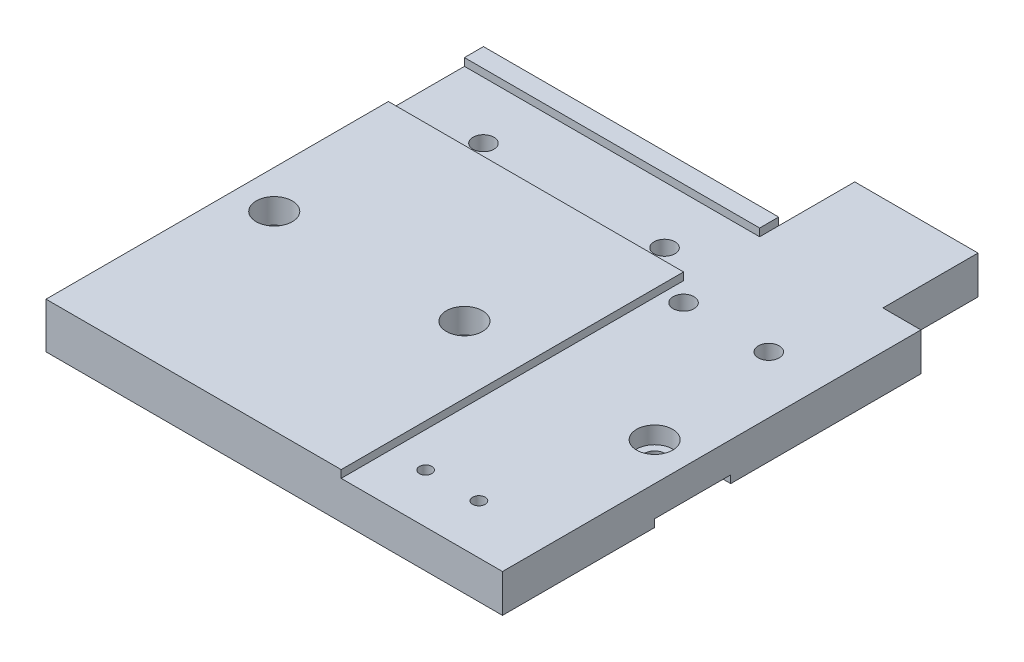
ISO-10303-21;
HEADER;
FILE_DESCRIPTION(('STEP AP214'),'2;1');
FILE_NAME('part.step','',(''),(''),'','','');
FILE_SCHEMA(('AUTOMOTIVE_DESIGN { 1 0 10303 214 1 1 1 1 }'));
ENDSEC;
DATA;
#1=APPLICATION_CONTEXT('core data for automotive mechanical design processes');
#2=APPLICATION_PROTOCOL_DEFINITION('international standard','automotive_design',2000,#1);
#3=PRODUCT_CONTEXT('',#1,'mechanical');
#4=PRODUCT('Part','Part','',(#3));
#5=PRODUCT_RELATED_PRODUCT_CATEGORY('part','',(#4));
#6=PRODUCT_DEFINITION_FORMATION('','',#4);
#7=PRODUCT_DEFINITION_CONTEXT('part definition',#1,'design');
#8=PRODUCT_DEFINITION('design','',#6,#7);
#9=PRODUCT_DEFINITION_SHAPE('','',#8);
#10=(LENGTH_UNIT() NAMED_UNIT(*) SI_UNIT(.MILLI.,.METRE.));
#11=(NAMED_UNIT(*) PLANE_ANGLE_UNIT() SI_UNIT($,.RADIAN.));
#12=(NAMED_UNIT(*) SI_UNIT($,.STERADIAN.) SOLID_ANGLE_UNIT());
#13=UNCERTAINTY_MEASURE_WITH_UNIT(LENGTH_MEASURE(1.E-05),#10,'distance_accuracy_value','');
#14=(GEOMETRIC_REPRESENTATION_CONTEXT(3) GLOBAL_UNCERTAINTY_ASSIGNED_CONTEXT((#13)) GLOBAL_UNIT_ASSIGNED_CONTEXT((#10,
#11,#12)) REPRESENTATION_CONTEXT('',''));
#15=CARTESIAN_POINT('',(0.,0.,0.));
#16=DIRECTION('',(0.,0.,1.));
#17=DIRECTION('',(1.,0.,0.));
#18=AXIS2_PLACEMENT_3D('',#15,#16,#17);
#19=CARTESIAN_POINT('',(77.5999999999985,10.0000000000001,135.));
#20=DIRECTION('',(-1.,0.,0.));
#21=DIRECTION('',(0.,0.,1.));
#22=AXIS2_PLACEMENT_3D('',#19,#20,#21);
#23=PLANE('',#22);
#24=DIRECTION('',(0.,0.,-1.));
#25=VECTOR('',#24,1.);
#26=CARTESIAN_POINT('',(77.5999999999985,10.0000000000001,135.));
#27=LINE('',#26,#25);
#28=CARTESIAN_POINT('',(77.5999999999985,10.0000000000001,135.));
#29=VERTEX_POINT('',#28);
#30=CARTESIAN_POINT('',(77.5999999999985,10.0000000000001,45.));
#31=VERTEX_POINT('',#30);
#32=EDGE_CURVE('E175',#29,#31,#27,.T.);
#33=ORIENTED_EDGE('',*,*,#32,.T.);
#34=DIRECTION('',(0.,1.,0.));
#35=VECTOR('',#34,1.);
#36=CARTESIAN_POINT('',(77.5999999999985,-70.1358845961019,45.));
#37=LINE('',#36,#35);
#38=CARTESIAN_POINT('',(77.5999999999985,12.0000000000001,45.));
#39=VERTEX_POINT('',#38);
#40=EDGE_CURVE('E157',#31,#39,#37,.T.);
#41=ORIENTED_EDGE('',*,*,#40,.T.);
#42=DIRECTION('',(0.,0.,-1.));
#43=VECTOR('',#42,1.);
#44=CARTESIAN_POINT('',(77.5999999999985,12.0000000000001,135.));
#45=LINE('',#44,#43);
#46=CARTESIAN_POINT('',(77.5999999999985,12.0000000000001,135.));
#47=VERTEX_POINT('',#46);
#48=EDGE_CURVE('E190',#47,#39,#45,.T.);
#49=ORIENTED_EDGE('',*,*,#48,.F.);
#50=DIRECTION('',(0.,1.,0.));
#51=VECTOR('',#50,1.);
#52=CARTESIAN_POINT('',(77.5999999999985,10.0000000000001,135.));
#53=LINE('',#52,#51);
#54=EDGE_CURVE('E183',#29,#47,#53,.T.);
#55=ORIENTED_EDGE('',*,*,#54,.F.);
#56=EDGE_LOOP('',(#33,#41,#49,#55));
#57=FACE_BOUND('',#56,.T.);
#58=ADVANCED_FACE('F34',(#57),#23,.F.);
#59=CARTESIAN_POINT('',(0.,12.0000000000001,135.));
#60=DIRECTION('',(0.,-1.,0.));
#61=DIRECTION('',(0.,0.,-1.));
#62=AXIS2_PLACEMENT_3D('',#59,#60,#61);
#63=PLANE('',#62);
#64=CARTESIAN_POINT('',(10.,12.0000000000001,85.));
#65=DIRECTION('',(0.,1.,0.));
#66=DIRECTION('',(0.,0.,1.));
#67=AXIS2_PLACEMENT_3D('',#64,#65,#66);
#68=CIRCLE('',#67,4.75);
#69=CARTESIAN_POINT('',(10.,12.0000000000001,89.75));
#70=VERTEX_POINT('',#69);
#71=EDGE_CURVE('E225',#70,#70,#68,.T.);
#72=ORIENTED_EDGE('',*,*,#71,.F.);
#73=EDGE_LOOP('',(#72));
#74=FACE_BOUND('',#73,.T.);
#75=CARTESIAN_POINT('',(60.,12.0000000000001,85.));
#76=DIRECTION('',(0.,1.,0.));
#77=DIRECTION('',(0.,0.,1.));
#78=AXIS2_PLACEMENT_3D('',#75,#76,#77);
#79=CIRCLE('',#78,4.75);
#80=CARTESIAN_POINT('',(60.,12.0000000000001,89.75));
#81=VERTEX_POINT('',#80);
#82=EDGE_CURVE('E232',#81,#81,#79,.T.);
#83=ORIENTED_EDGE('',*,*,#82,.F.);
#84=EDGE_LOOP('',(#83));
#85=FACE_BOUND('',#84,.T.);
#86=ORIENTED_EDGE('',*,*,#48,.T.);
#87=DIRECTION('',(1.,0.,0.));
#88=VECTOR('',#87,1.);
#89=CARTESIAN_POINT('',(0.,12.0000000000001,45.));
#90=LINE('',#89,#88);
#91=CARTESIAN_POINT('',(0.,12.0000000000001,45.));
#92=VERTEX_POINT('',#91);
#93=EDGE_CURVE('E163',#92,#39,#90,.T.);
#94=ORIENTED_EDGE('',*,*,#93,.F.);
#95=DIRECTION('',(0.,0.,-1.));
#96=VECTOR('',#95,1.);
#97=CARTESIAN_POINT('',(0.,12.0000000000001,135.));
#98=LINE('',#97,#96);
#99=CARTESIAN_POINT('',(0.,12.0000000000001,135.));
#100=VERTEX_POINT('',#99);
#101=EDGE_CURVE('E310',#100,#92,#98,.T.);
#102=ORIENTED_EDGE('',*,*,#101,.F.);
#103=DIRECTION('',(-1.,0.,0.));
#104=VECTOR('',#103,1.);
#105=CARTESIAN_POINT('',(0.,12.0000000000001,135.));
#106=LINE('',#105,#104);
#107=EDGE_CURVE('E298',#47,#100,#106,.T.);
#108=ORIENTED_EDGE('',*,*,#107,.F.);
#109=EDGE_LOOP('',(#86,#94,#102,#108));
#110=FACE_BOUND('',#109,.T.);
#111=ADVANCED_FACE('F408',(#74,#85,#110),#63,.F.);
#112=CARTESIAN_POINT('',(110.,-123.,85.));
#113=DIRECTION('',(0.,1.,0.));
#114=DIRECTION('',(0.,0.,1.));
#115=AXIS2_PLACEMENT_3D('',#112,#113,#114);
#116=CYLINDRICAL_SURFACE('',#115,2.75);
#117=CARTESIAN_POINT('',(110.,5.50000000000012,85.));
#118=DIRECTION('',(0.,1.,0.));
#119=DIRECTION('',(0.,0.,1.));
#120=AXIS2_PLACEMENT_3D('',#117,#118,#119);
#121=CIRCLE('',#120,2.75);
#122=CARTESIAN_POINT('',(110.,5.50000000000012,87.75));
#123=VERTEX_POINT('',#122);
#124=EDGE_CURVE('E227',#123,#123,#121,.F.);
#125=ORIENTED_EDGE('',*,*,#124,.F.);
#126=EDGE_LOOP('',(#125));
#127=FACE_BOUND('',#126,.T.);
#128=CARTESIAN_POINT('',(110.,2.00000000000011,85.));
#129=DIRECTION('',(0.,-1.,0.));
#130=DIRECTION('',(0.,0.,-1.));
#131=AXIS2_PLACEMENT_3D('',#128,#129,#130);
#132=CIRCLE('',#131,2.75);
#133=CARTESIAN_POINT('',(110.,2.00000000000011,82.25));
#134=VERTEX_POINT('',#133);
#135=EDGE_CURVE('E384',#134,#134,#132,.F.);
#136=ORIENTED_EDGE('',*,*,#135,.F.);
#137=EDGE_LOOP('',(#136));
#138=FACE_BOUND('',#137,.T.);
#139=ADVANCED_FACE('F413',(#127,#138),#116,.F.);
#140=CARTESIAN_POINT('',(60.,-123.,85.));
#141=DIRECTION('',(0.,1.,0.));
#142=DIRECTION('',(0.,0.,1.));
#143=AXIS2_PLACEMENT_3D('',#140,#141,#142);
#144=CYLINDRICAL_SURFACE('',#143,2.75);
#145=CARTESIAN_POINT('',(60.,5.50000000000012,85.));
#146=DIRECTION('',(0.,1.,0.));
#147=DIRECTION('',(0.,0.,1.));
#148=AXIS2_PLACEMENT_3D('',#145,#146,#147);
#149=CIRCLE('',#148,2.75);
#150=CARTESIAN_POINT('',(60.,5.50000000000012,87.75));
#151=VERTEX_POINT('',#150);
#152=EDGE_CURVE('E222',#151,#151,#149,.F.);
#153=ORIENTED_EDGE('',*,*,#152,.F.);
#154=EDGE_LOOP('',(#153));
#155=FACE_BOUND('',#154,.T.);
#156=CARTESIAN_POINT('',(60.,2.00000000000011,85.));
#157=DIRECTION('',(0.,-1.,0.));
#158=DIRECTION('',(0.,0.,-1.));
#159=AXIS2_PLACEMENT_3D('',#156,#157,#158);
#160=CIRCLE('',#159,2.75);
#161=CARTESIAN_POINT('',(60.,2.00000000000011,82.25));
#162=VERTEX_POINT('',#161);
#163=EDGE_CURVE('E381',#162,#162,#160,.F.);
#164=ORIENTED_EDGE('',*,*,#163,.F.);
#165=EDGE_LOOP('',(#164));
#166=FACE_BOUND('',#165,.T.);
#167=ADVANCED_FACE('F459',(#155,#166),#144,.F.);
#168=CARTESIAN_POINT('',(10.,-123.,85.));
#169=DIRECTION('',(0.,1.,0.));
#170=DIRECTION('',(0.,0.,1.));
#171=AXIS2_PLACEMENT_3D('',#168,#169,#170);
#172=CYLINDRICAL_SURFACE('',#171,2.75);
#173=CARTESIAN_POINT('',(10.,5.50000000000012,85.));
#174=DIRECTION('',(0.,1.,0.));
#175=DIRECTION('',(0.,0.,1.));
#176=AXIS2_PLACEMENT_3D('',#173,#174,#175);
#177=CIRCLE('',#176,2.75);
#178=CARTESIAN_POINT('',(10.,5.50000000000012,87.75));
#179=VERTEX_POINT('',#178);
#180=EDGE_CURVE('E217',#179,#179,#177,.F.);
#181=ORIENTED_EDGE('',*,*,#180,.F.);
#182=EDGE_LOOP('',(#181));
#183=FACE_BOUND('',#182,.T.);
#184=CARTESIAN_POINT('',(10.,2.00000000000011,85.));
#185=DIRECTION('',(0.,-1.,0.));
#186=DIRECTION('',(0.,0.,-1.));
#187=AXIS2_PLACEMENT_3D('',#184,#185,#186);
#188=CIRCLE('',#187,2.75);
#189=CARTESIAN_POINT('',(10.,2.00000000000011,82.25));
#190=VERTEX_POINT('',#189);
#191=EDGE_CURVE('E375',#190,#190,#188,.F.);
#192=ORIENTED_EDGE('',*,*,#191,.F.);
#193=EDGE_LOOP('',(#192));
#194=FACE_BOUND('',#193,.T.);
#195=ADVANCED_FACE('F463',(#183,#194),#172,.F.);
#196=CARTESIAN_POINT('',(0.,1.13686837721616E-13,135.));
#197=DIRECTION('',(0.,1.,0.));
#198=DIRECTION('',(0.,0.,1.));
#199=AXIS2_PLACEMENT_3D('',#196,#197,#198);
#200=PLANE('',#199);
#201=CARTESIAN_POINT('',(20.,1.11022302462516E-13,40.));
#202=DIRECTION('',(0.,1.,0.));
#203=DIRECTION('',(0.,0.,1.));
#204=AXIS2_PLACEMENT_3D('',#201,#202,#203);
#205=CIRCLE('',#204,2.75);
#206=CARTESIAN_POINT('',(20.,1.11022302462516E-13,42.75));
#207=VERTEX_POINT('',#206);
#208=EDGE_CURVE('E285',#207,#207,#205,.T.);
#209=ORIENTED_EDGE('',*,*,#208,.T.);
#210=EDGE_LOOP('',(#209));
#211=FACE_BOUND('',#210,.T.);
#212=CARTESIAN_POINT('',(67.5999999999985,1.11022302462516E-13,40.));
#213=DIRECTION('',(0.,1.,0.));
#214=DIRECTION('',(0.,0.,1.));
#215=AXIS2_PLACEMENT_3D('',#212,#213,#214);
#216=CIRCLE('',#215,2.75);
#217=CARTESIAN_POINT('',(67.5999999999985,1.11022302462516E-13,42.75));
#218=VERTEX_POINT('',#217);
#219=EDGE_CURVE('E282',#218,#218,#216,.T.);
#220=ORIENTED_EDGE('',*,*,#219,.T.);
#221=EDGE_LOOP('',(#220));
#222=FACE_BOUND('',#221,.T.);
#223=CARTESIAN_POINT('',(105.,1.11022302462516E-13,50.));
#224=DIRECTION('',(0.,1.,0.));
#225=DIRECTION('',(0.,0.,1.));
#226=AXIS2_PLACEMENT_3D('',#223,#224,#225);
#227=CIRCLE('',#226,2.75);
#228=CARTESIAN_POINT('',(105.,1.11022302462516E-13,52.75));
#229=VERTEX_POINT('',#228);
#230=EDGE_CURVE('E201',#229,#229,#227,.T.);
#231=ORIENTED_EDGE('',*,*,#230,.T.);
#232=EDGE_LOOP('',(#231));
#233=FACE_BOUND('',#232,.T.);
#234=CARTESIAN_POINT('',(82.5999999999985,1.11022302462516E-13,50.));
#235=DIRECTION('',(0.,1.,0.));
#236=DIRECTION('',(0.,0.,1.));
#237=AXIS2_PLACEMENT_3D('',#234,#235,#236);
#238=CIRCLE('',#237,2.75);
#239=CARTESIAN_POINT('',(82.5999999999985,1.11022302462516E-13,52.75));
#240=VERTEX_POINT('',#239);
#241=EDGE_CURVE('E202',#240,#240,#238,.T.);
#242=ORIENTED_EDGE('',*,*,#241,.T.);
#243=EDGE_LOOP('',(#242));
#244=FACE_BOUND('',#243,.T.);
#245=DIRECTION('',(1.,0.,0.));
#246=VECTOR('',#245,1.);
#247=CARTESIAN_POINT('',(0.,1.13686837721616E-13,74.9999999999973));
#248=LINE('',#247,#246);
#249=CARTESIAN_POINT('',(0.,1.13686837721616E-13,74.9999999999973));
#250=VERTEX_POINT('',#249);
#251=CARTESIAN_POINT('',(120.,1.13686837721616E-13,74.9999999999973));
#252=VERTEX_POINT('',#251);
#253=EDGE_CURVE('E350',#250,#252,#248,.T.);
#254=ORIENTED_EDGE('',*,*,#253,.F.);
#255=DIRECTION('',(0.,0.,-1.));
#256=VECTOR('',#255,1.);
#257=CARTESIAN_POINT('',(0.,1.13686837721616E-13,135.));
#258=LINE('',#257,#256);
#259=CARTESIAN_POINT('',(0.,1.11022302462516E-13,20.));
#260=VERTEX_POINT('',#259);
#261=EDGE_CURVE('E302',#250,#260,#258,.T.);
#262=ORIENTED_EDGE('',*,*,#261,.T.);
#263=DIRECTION('',(-1.,0.,0.));
#264=VECTOR('',#263,1.);
#265=CARTESIAN_POINT('',(0.,1.13686837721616E-13,20.));
#266=LINE('',#265,#264);
#267=CARTESIAN_POINT('',(77.5999999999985,1.11022302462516E-13,20.));
#268=VERTEX_POINT('',#267);
#269=EDGE_CURVE('E270',#268,#260,#266,.T.);
#270=ORIENTED_EDGE('',*,*,#269,.F.);
#271=DIRECTION('',(0.,0.,1.));
#272=VECTOR('',#271,1.);
#273=CARTESIAN_POINT('',(77.5999999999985,1.13686837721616E-13,135.));
#274=LINE('',#273,#272);
#275=CARTESIAN_POINT('',(77.5999999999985,1.11022302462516E-13,0.));
#276=VERTEX_POINT('',#275);
#277=EDGE_CURVE('E268',#276,#268,#274,.T.);
#278=ORIENTED_EDGE('',*,*,#277,.F.);
#279=DIRECTION('',(1.,0.,0.));
#280=VECTOR('',#279,1.);
#281=CARTESIAN_POINT('',(0.,1.13686837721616E-13,0.));
#282=LINE('',#281,#280);
#283=CARTESIAN_POINT('',(110.,1.13686837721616E-13,0.));
#284=VERTEX_POINT('',#283);
#285=EDGE_CURVE('E288',#276,#284,#282,.T.);
#286=ORIENTED_EDGE('',*,*,#285,.T.);
#287=DIRECTION('',(0.,0.,-1.));
#288=VECTOR('',#287,1.);
#289=CARTESIAN_POINT('',(110.,1.13686837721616E-13,135.));
#290=LINE('',#289,#288);
#291=CARTESIAN_POINT('',(110.,1.11022302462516E-13,25.));
#292=VERTEX_POINT('',#291);
#293=EDGE_CURVE('E264',#292,#284,#290,.T.);
#294=ORIENTED_EDGE('',*,*,#293,.F.);
#295=DIRECTION('',(-1.,0.,0.));
#296=VECTOR('',#295,1.);
#297=CARTESIAN_POINT('',(0.,1.13686837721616E-13,25.));
#298=LINE('',#297,#296);
#299=CARTESIAN_POINT('',(120.,1.11022302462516E-13,25.));
#300=VERTEX_POINT('',#299);
#301=EDGE_CURVE('E214',#300,#292,#298,.T.);
#302=ORIENTED_EDGE('',*,*,#301,.F.);
#303=DIRECTION('',(0.,0.,-1.));
#304=VECTOR('',#303,1.);
#305=CARTESIAN_POINT('',(120.,1.13686837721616E-13,135.));
#306=LINE('',#305,#304);
#307=EDGE_CURVE('E188',#252,#300,#306,.T.);
#308=ORIENTED_EDGE('',*,*,#307,.F.);
#309=EDGE_LOOP('',(#254,#262,#270,#278,#286,#294,#302,#308));
#310=FACE_BOUND('',#309,.T.);
#311=ADVANCED_FACE('F36',(#211,#222,#233,#244,#310),#200,.F.);
#312=CARTESIAN_POINT('',(86.7999999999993,1.11022302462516E-13,122.));
#313=DIRECTION('',(0.,1.,0.));
#314=DIRECTION('',(0.,0.,1.));
#315=AXIS2_PLACEMENT_3D('',#312,#313,#314);
#316=CIRCLE('',#315,1.65);
#317=CARTESIAN_POINT('',(86.7999999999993,1.11022302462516E-13,123.65));
#318=VERTEX_POINT('',#317);
#319=EDGE_CURVE('E206',#318,#318,#316,.T.);
#320=ORIENTED_EDGE('',*,*,#319,.T.);
#321=EDGE_LOOP('',(#320));
#322=FACE_BOUND('',#321,.T.);
#323=CARTESIAN_POINT('',(100.799999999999,1.11022302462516E-13,122.));
#324=DIRECTION('',(0.,1.,0.));
#325=DIRECTION('',(0.,0.,1.));
#326=AXIS2_PLACEMENT_3D('',#323,#324,#325);
#327=CIRCLE('',#326,1.65);
#328=CARTESIAN_POINT('',(100.799999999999,1.11022302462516E-13,123.65));
#329=VERTEX_POINT('',#328);
#330=EDGE_CURVE('E210',#329,#329,#327,.T.);
#331=ORIENTED_EDGE('',*,*,#330,.T.);
#332=EDGE_LOOP('',(#331));
#333=FACE_BOUND('',#332,.T.);
#334=DIRECTION('',(1.,0.,0.));
#335=VECTOR('',#334,1.);
#336=CARTESIAN_POINT('',(0.,0.,94.9999999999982));
#337=LINE('',#336,#335);
#338=CARTESIAN_POINT('',(0.,1.13686837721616E-13,94.9999999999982));
#339=VERTEX_POINT('',#338);
#340=CARTESIAN_POINT('',(120.,0.,94.9999999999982));
#341=VERTEX_POINT('',#340);
#342=EDGE_CURVE('E59',#339,#341,#337,.T.);
#343=ORIENTED_EDGE('',*,*,#342,.T.);
#344=CARTESIAN_POINT('',(120.,1.13686837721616E-13,135.));
#345=VERTEX_POINT('',#344);
#346=EDGE_CURVE('E194',#345,#341,#306,.T.);
#347=ORIENTED_EDGE('',*,*,#346,.F.);
#348=DIRECTION('',(1.,0.,0.));
#349=VECTOR('',#348,1.);
#350=CARTESIAN_POINT('',(0.,1.13686837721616E-13,135.));
#351=LINE('',#350,#349);
#352=CARTESIAN_POINT('',(0.,1.13686837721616E-13,135.));
#353=VERTEX_POINT('',#352);
#354=EDGE_CURVE('E289',#353,#345,#351,.T.);
#355=ORIENTED_EDGE('',*,*,#354,.F.);
#356=EDGE_CURVE('E307',#353,#339,#258,.T.);
#357=ORIENTED_EDGE('',*,*,#356,.T.);
#358=EDGE_LOOP('',(#343,#347,#355,#357));
#359=FACE_BOUND('',#358,.T.);
#360=ADVANCED_FACE('F428',(#322,#333,#359),#200,.F.);
#361=CARTESIAN_POINT('',(120.,1.13686837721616E-13,135.));
#362=DIRECTION('',(-1.,0.,0.));
#363=DIRECTION('',(0.,0.,1.));
#364=AXIS2_PLACEMENT_3D('',#361,#362,#363);
#365=PLANE('',#364);
#366=DIRECTION('',(0.,-1.,0.));
#367=VECTOR('',#366,1.);
#368=CARTESIAN_POINT('',(120.,1.13686837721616E-13,74.9999999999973));
#369=LINE('',#368,#367);
#370=CARTESIAN_POINT('',(120.,2.00000000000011,74.9999999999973));
#371=VERTEX_POINT('',#370);
#372=EDGE_CURVE('E371',#371,#252,#369,.T.);
#373=ORIENTED_EDGE('',*,*,#372,.T.);
#374=ORIENTED_EDGE('',*,*,#307,.T.);
#375=DIRECTION('',(0.,1.,0.));
#376=VECTOR('',#375,1.);
#377=CARTESIAN_POINT('',(120.,-123.,25.));
#378=LINE('',#377,#376);
#379=CARTESIAN_POINT('',(120.,10.0000000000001,25.));
#380=VERTEX_POINT('',#379);
#381=EDGE_CURVE('E249',#300,#380,#378,.T.);
#382=ORIENTED_EDGE('',*,*,#381,.T.);
#383=DIRECTION('',(0.,0.,-1.));
#384=VECTOR('',#383,1.);
#385=CARTESIAN_POINT('',(120.,10.0000000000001,135.));
#386=LINE('',#385,#384);
#387=CARTESIAN_POINT('',(120.,10.0000000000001,135.));
#388=VERTEX_POINT('',#387);
#389=EDGE_CURVE('E184',#388,#380,#386,.T.);
#390=ORIENTED_EDGE('',*,*,#389,.F.);
#391=DIRECTION('',(0.,1.,0.));
#392=VECTOR('',#391,1.);
#393=CARTESIAN_POINT('',(120.,1.13686837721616E-13,135.));
#394=LINE('',#393,#392);
#395=EDGE_CURVE('E292',#345,#388,#394,.T.);
#396=ORIENTED_EDGE('',*,*,#395,.F.);
#397=ORIENTED_EDGE('',*,*,#346,.T.);
#398=DIRECTION('',(0.,1.,4.57966997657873E-13));
#399=VECTOR('',#398,1.);
#400=CARTESIAN_POINT('',(120.,0.,94.9999999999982));
#401=LINE('',#400,#399);
#402=CARTESIAN_POINT('',(120.,2.00000000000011,94.9999999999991));
#403=VERTEX_POINT('',#402);
#404=EDGE_CURVE('E364',#341,#403,#401,.T.);
#405=ORIENTED_EDGE('',*,*,#404,.T.);
#406=DIRECTION('',(0.,0.,-1.));
#407=VECTOR('',#406,1.);
#408=CARTESIAN_POINT('',(120.,2.00000000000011,94.9999999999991));
#409=LINE('',#408,#407);
#410=EDGE_CURVE('E367',#403,#371,#409,.T.);
#411=ORIENTED_EDGE('',*,*,#410,.T.);
#412=EDGE_LOOP('',(#373,#374,#382,#390,#396,#397,#405,#411));
#413=FACE_BOUND('',#412,.T.);
#414=ADVANCED_FACE('F425',(#413),#365,.F.);
#415=CARTESIAN_POINT('',(0.,1.13686837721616E-13,135.));
#416=DIRECTION('',(1.,0.,0.));
#417=DIRECTION('',(0.,0.,-1.));
#418=AXIS2_PLACEMENT_3D('',#415,#416,#417);
#419=PLANE('',#418);
#420=ORIENTED_EDGE('',*,*,#101,.T.);
#421=DIRECTION('',(0.,1.,0.));
#422=VECTOR('',#421,1.);
#423=CARTESIAN_POINT('',(0.,-70.1358845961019,45.));
#424=LINE('',#423,#422);
#425=CARTESIAN_POINT('',(0.,10.0000000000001,45.));
#426=VERTEX_POINT('',#425);
#427=EDGE_CURVE('E730',#426,#92,#424,.T.);
#428=ORIENTED_EDGE('',*,*,#427,.F.);
#429=DIRECTION('',(0.,0.,1.));
#430=VECTOR('',#429,1.);
#431=CARTESIAN_POINT('',(0.,10.0000000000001,25.));
#432=LINE('',#431,#430);
#433=CARTESIAN_POINT('',(0.,10.0000000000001,25.));
#434=VERTEX_POINT('',#433);
#435=EDGE_CURVE('E179',#434,#426,#432,.T.);
#436=ORIENTED_EDGE('',*,*,#435,.F.);
#437=DIRECTION('',(0.,1.,0.));
#438=VECTOR('',#437,1.);
#439=CARTESIAN_POINT('',(0.,-70.1358845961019,25.));
#440=LINE('',#439,#438);
#441=CARTESIAN_POINT('',(0.,12.0000000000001,25.));
#442=VERTEX_POINT('',#441);
#443=EDGE_CURVE('E321',#434,#442,#440,.T.);
#444=ORIENTED_EDGE('',*,*,#443,.T.);
#445=CARTESIAN_POINT('',(0.,12.0000000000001,20.));
#446=VERTEX_POINT('',#445);
#447=EDGE_CURVE('E309',#442,#446,#98,.T.);
#448=ORIENTED_EDGE('',*,*,#447,.T.);
#449=DIRECTION('',(0.,1.,0.));
#450=VECTOR('',#449,1.);
#451=CARTESIAN_POINT('',(0.,-123.,20.));
#452=LINE('',#451,#450);
#453=EDGE_CURVE('E250',#260,#446,#452,.T.);
#454=ORIENTED_EDGE('',*,*,#453,.F.);
#455=ORIENTED_EDGE('',*,*,#261,.F.);
#456=DIRECTION('',(0.,-1.,0.));
#457=VECTOR('',#456,1.);
#458=CARTESIAN_POINT('',(0.,1.13686837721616E-13,74.9999999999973));
#459=LINE('',#458,#457);
#460=CARTESIAN_POINT('',(0.,2.00000000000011,74.9999999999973));
#461=VERTEX_POINT('',#460);
#462=EDGE_CURVE('E353',#461,#250,#459,.T.);
#463=ORIENTED_EDGE('',*,*,#462,.F.);
#464=DIRECTION('',(0.,0.,-1.));
#465=VECTOR('',#464,1.);
#466=CARTESIAN_POINT('',(0.,2.00000000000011,94.9999999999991));
#467=LINE('',#466,#465);
#468=CARTESIAN_POINT('',(0.,2.00000000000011,94.9999999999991));
#469=VERTEX_POINT('',#468);
#470=EDGE_CURVE('E355',#469,#461,#467,.T.);
#471=ORIENTED_EDGE('',*,*,#470,.F.);
#472=DIRECTION('',(0.,1.,4.57966997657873E-13));
#473=VECTOR('',#472,1.);
#474=CARTESIAN_POINT('',(0.,0.,94.9999999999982));
#475=LINE('',#474,#473);
#476=EDGE_CURVE('E360',#339,#469,#475,.T.);
#477=ORIENTED_EDGE('',*,*,#476,.F.);
#478=ORIENTED_EDGE('',*,*,#356,.F.);
#479=DIRECTION('',(0.,-1.,0.));
#480=VECTOR('',#479,1.);
#481=CARTESIAN_POINT('',(0.,1.13686837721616E-13,135.));
#482=LINE('',#481,#480);
#483=EDGE_CURVE('E300',#100,#353,#482,.T.);
#484=ORIENTED_EDGE('',*,*,#483,.F.);
#485=EDGE_LOOP('',(#420,#428,#436,#444,#448,#454,#455,#463,#471,#477,#478,#484));
#486=FACE_BOUND('',#485,.T.);
#487=ADVANCED_FACE('F319',(#486),#419,.F.);
#488=CARTESIAN_POINT('',(77.5999999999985,10.0000000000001,135.));
#489=DIRECTION('',(0.,-1.,0.));
#490=DIRECTION('',(0.,0.,-1.));
#491=AXIS2_PLACEMENT_3D('',#488,#489,#490);
#492=PLANE('',#491);
#493=DIRECTION('',(0.,0.,-1.));
#494=VECTOR('',#493,1.);
#495=CARTESIAN_POINT('',(77.5999999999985,10.0000000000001,135.));
#496=LINE('',#495,#494);
#497=CARTESIAN_POINT('',(77.5999999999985,10.0000000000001,20.));
#498=VERTEX_POINT('',#497);
#499=CARTESIAN_POINT('',(77.5999999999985,10.0000000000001,0.));
#500=VERTEX_POINT('',#499);
#501=EDGE_CURVE('E266',#498,#500,#496,.T.);
#502=ORIENTED_EDGE('',*,*,#501,.F.);
#503=CARTESIAN_POINT('',(77.5999999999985,10.0000000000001,25.));
#504=VERTEX_POINT('',#503);
#505=EDGE_CURVE('E185',#504,#498,#27,.T.);
#506=ORIENTED_EDGE('',*,*,#505,.F.);
#507=DIRECTION('',(-1.,0.,0.));
#508=VECTOR('',#507,1.);
#509=CARTESIAN_POINT('',(0.,10.0000000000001,25.));
#510=LINE('',#509,#508);
#511=EDGE_CURVE('E733',#504,#434,#510,.T.);
#512=ORIENTED_EDGE('',*,*,#511,.T.);
#513=ORIENTED_EDGE('',*,*,#435,.T.);
#514=DIRECTION('',(1.,0.,0.));
#515=VECTOR('',#514,1.);
#516=CARTESIAN_POINT('',(0.,10.0000000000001,45.));
#517=LINE('',#516,#515);
#518=EDGE_CURVE('E160',#426,#31,#517,.T.);
#519=ORIENTED_EDGE('',*,*,#518,.T.);
#520=ORIENTED_EDGE('',*,*,#32,.F.);
#521=DIRECTION('',(-1.,0.,0.));
#522=VECTOR('',#521,1.);
#523=CARTESIAN_POINT('',(77.5999999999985,10.0000000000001,135.));
#524=LINE('',#523,#522);
#525=EDGE_CURVE('E295',#388,#29,#524,.T.);
#526=ORIENTED_EDGE('',*,*,#525,.F.);
#527=ORIENTED_EDGE('',*,*,#389,.T.);
#528=DIRECTION('',(1.,0.,0.));
#529=VECTOR('',#528,1.);
#530=CARTESIAN_POINT('',(77.5999999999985,10.0000000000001,25.));
#531=LINE('',#530,#529);
#532=CARTESIAN_POINT('',(110.,10.0000000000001,25.));
#533=VERTEX_POINT('',#532);
#534=EDGE_CURVE('E12',#533,#380,#531,.T.);
#535=ORIENTED_EDGE('',*,*,#534,.F.);
#536=DIRECTION('',(0.,0.,1.));
#537=VECTOR('',#536,1.);
#538=CARTESIAN_POINT('',(110.,10.0000000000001,135.));
#539=LINE('',#538,#537);
#540=CARTESIAN_POINT('',(110.,10.0000000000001,0.));
#541=VERTEX_POINT('',#540);
#542=EDGE_CURVE('E253',#541,#533,#539,.T.);
#543=ORIENTED_EDGE('',*,*,#542,.F.);
#544=DIRECTION('',(-1.,0.,0.));
#545=VECTOR('',#544,1.);
#546=CARTESIAN_POINT('',(77.5999999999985,10.0000000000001,0.));
#547=LINE('',#546,#545);
#548=EDGE_CURVE('E293',#541,#500,#547,.T.);
#549=ORIENTED_EDGE('',*,*,#548,.T.);
#550=EDGE_LOOP('',(#502,#506,#512,#513,#519,#520,#526,#527,#535,#543,#549));
#551=FACE_BOUND('',#550,.T.);
#552=CARTESIAN_POINT('',(100.799999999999,10.0000000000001,122.));
#553=DIRECTION('',(0.,-1.,0.));
#554=DIRECTION('',(0.,0.,-1.));
#555=AXIS2_PLACEMENT_3D('',#552,#553,#554);
#556=CIRCLE('',#555,1.65);
#557=CARTESIAN_POINT('',(100.799999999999,10.0000000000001,120.35));
#558=VERTEX_POINT('',#557);
#559=EDGE_CURVE('E211',#558,#558,#556,.T.);
#560=ORIENTED_EDGE('',*,*,#559,.T.);
#561=EDGE_LOOP('',(#560));
#562=FACE_BOUND('',#561,.T.);
#563=CARTESIAN_POINT('',(86.7999999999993,10.0000000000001,122.));
#564=DIRECTION('',(0.,-1.,0.));
#565=DIRECTION('',(0.,0.,-1.));
#566=AXIS2_PLACEMENT_3D('',#563,#564,#565);
#567=CIRCLE('',#566,1.65);
#568=CARTESIAN_POINT('',(86.7999999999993,10.0000000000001,120.35));
#569=VERTEX_POINT('',#568);
#570=EDGE_CURVE('E207',#569,#569,#567,.T.);
#571=ORIENTED_EDGE('',*,*,#570,.T.);
#572=EDGE_LOOP('',(#571));
#573=FACE_BOUND('',#572,.T.);
#574=CARTESIAN_POINT('',(82.5999999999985,10.0000000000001,50.));
#575=DIRECTION('',(0.,-1.,0.));
#576=DIRECTION('',(0.,0.,-1.));
#577=AXIS2_PLACEMENT_3D('',#574,#575,#576);
#578=CIRCLE('',#577,2.75);
#579=CARTESIAN_POINT('',(82.5999999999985,10.0000000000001,47.25));
#580=VERTEX_POINT('',#579);
#581=EDGE_CURVE('E203',#580,#580,#578,.T.);
#582=ORIENTED_EDGE('',*,*,#581,.T.);
#583=EDGE_LOOP('',(#582));
#584=FACE_BOUND('',#583,.T.);
#585=CARTESIAN_POINT('',(105.,10.0000000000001,50.));
#586=DIRECTION('',(0.,-1.,0.));
#587=DIRECTION('',(0.,0.,-1.));
#588=AXIS2_PLACEMENT_3D('',#585,#586,#587);
#589=CIRCLE('',#588,2.75);
#590=CARTESIAN_POINT('',(105.,10.0000000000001,47.25));
#591=VERTEX_POINT('',#590);
#592=EDGE_CURVE('E198',#591,#591,#589,.T.);
#593=ORIENTED_EDGE('',*,*,#592,.T.);
#594=EDGE_LOOP('',(#593));
#595=FACE_BOUND('',#594,.T.);
#596=CARTESIAN_POINT('',(110.,10.0000000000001,85.));
#597=DIRECTION('',(0.,-1.,0.));
#598=DIRECTION('',(0.,0.,-1.));
#599=AXIS2_PLACEMENT_3D('',#596,#597,#598);
#600=CIRCLE('',#599,4.75);
#601=CARTESIAN_POINT('',(110.,10.0000000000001,89.75));
#602=VERTEX_POINT('',#601);
#603=EDGE_CURVE('E229',#602,#602,#600,.T.);
#604=ORIENTED_EDGE('',*,*,#603,.T.);
#605=EDGE_LOOP('',(#604));
#606=FACE_BOUND('',#605,.T.);
#607=CARTESIAN_POINT('',(67.5999999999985,10.0000000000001,40.));
#608=DIRECTION('',(0.,-1.,0.));
#609=DIRECTION('',(0.,0.,-1.));
#610=AXIS2_PLACEMENT_3D('',#607,#608,#609);
#611=CIRCLE('',#610,2.75);
#612=CARTESIAN_POINT('',(67.5999999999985,10.0000000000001,37.25));
#613=VERTEX_POINT('',#612);
#614=EDGE_CURVE('E38',#613,#613,#611,.F.);
#615=ORIENTED_EDGE('',*,*,#614,.F.);
#616=EDGE_LOOP('',(#615));
#617=FACE_BOUND('',#616,.T.);
#618=CARTESIAN_POINT('',(20.,10.0000000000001,40.));
#619=DIRECTION('',(0.,-1.,0.));
#620=DIRECTION('',(0.,0.,-1.));
#621=AXIS2_PLACEMENT_3D('',#618,#619,#620);
#622=CIRCLE('',#621,2.75);
#623=CARTESIAN_POINT('',(20.,10.0000000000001,37.25));
#624=VERTEX_POINT('',#623);
#625=EDGE_CURVE('E368',#624,#624,#622,.F.);
#626=ORIENTED_EDGE('',*,*,#625,.F.);
#627=EDGE_LOOP('',(#626));
#628=FACE_BOUND('',#627,.T.);
#629=ADVANCED_FACE('F172',(#551,#562,#573,#584,#595,#606,#617,#628),#492,.F.);
#630=CARTESIAN_POINT('',(77.5999999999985,12.0000000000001,25.));
#631=VERTEX_POINT('',#630);
#632=CARTESIAN_POINT('',(77.5999999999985,12.0000000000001,20.));
#633=VERTEX_POINT('',#632);
#634=EDGE_CURVE('E312',#631,#633,#45,.T.);
#635=ORIENTED_EDGE('',*,*,#634,.F.);
#636=DIRECTION('',(0.,1.,0.));
#637=VECTOR('',#636,1.);
#638=CARTESIAN_POINT('',(77.5999999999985,-70.1358845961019,25.));
#639=LINE('',#638,#637);
#640=EDGE_CURVE('E51',#504,#631,#639,.T.);
#641=ORIENTED_EDGE('',*,*,#640,.F.);
#642=ORIENTED_EDGE('',*,*,#505,.T.);
#643=DIRECTION('',(0.,1.,0.));
#644=VECTOR('',#643,1.);
#645=CARTESIAN_POINT('',(77.5999999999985,-123.,20.));
#646=LINE('',#645,#644);
#647=EDGE_CURVE('E255',#498,#633,#646,.T.);
#648=ORIENTED_EDGE('',*,*,#647,.T.);
#649=EDGE_LOOP('',(#635,#641,#642,#648));
#650=FACE_BOUND('',#649,.T.);
#651=ADVANCED_FACE('F332',(#650),#23,.F.);
#652=ORIENTED_EDGE('',*,*,#447,.F.);
#653=DIRECTION('',(-1.,0.,0.));
#654=VECTOR('',#653,1.);
#655=CARTESIAN_POINT('',(0.,12.0000000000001,25.));
#656=LINE('',#655,#654);
#657=EDGE_CURVE('E181',#631,#442,#656,.T.);
#658=ORIENTED_EDGE('',*,*,#657,.F.);
#659=ORIENTED_EDGE('',*,*,#634,.T.);
#660=DIRECTION('',(-1.,0.,0.));
#661=VECTOR('',#660,1.);
#662=CARTESIAN_POINT('',(0.,12.0000000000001,20.));
#663=LINE('',#662,#661);
#664=EDGE_CURVE('E220',#633,#446,#663,.T.);
#665=ORIENTED_EDGE('',*,*,#664,.T.);
#666=EDGE_LOOP('',(#652,#658,#659,#665));
#667=FACE_BOUND('',#666,.T.);
#668=ADVANCED_FACE('F329',(#667),#63,.F.);
#669=CARTESIAN_POINT('',(120.,1.13686837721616E-13,0.));
#670=DIRECTION('',(0.,0.,1.));
#671=DIRECTION('',(1.,0.,0.));
#672=AXIS2_PLACEMENT_3D('',#669,#670,#671);
#673=PLANE('',#672);
#674=DIRECTION('',(0.,-1.,0.));
#675=VECTOR('',#674,1.);
#676=CARTESIAN_POINT('',(77.5999999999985,1.13686837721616E-13,0.));
#677=LINE('',#676,#675);
#678=EDGE_CURVE('E43',#500,#276,#677,.T.);
#679=ORIENTED_EDGE('',*,*,#678,.F.);
#680=ORIENTED_EDGE('',*,*,#548,.F.);
#681=DIRECTION('',(0.,1.,0.));
#682=VECTOR('',#681,1.);
#683=CARTESIAN_POINT('',(110.,1.13686837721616E-13,0.));
#684=LINE('',#683,#682);
#685=EDGE_CURVE('E197',#284,#541,#684,.T.);
#686=ORIENTED_EDGE('',*,*,#685,.F.);
#687=ORIENTED_EDGE('',*,*,#285,.F.);
#688=EDGE_LOOP('',(#679,#680,#686,#687));
#689=FACE_BOUND('',#688,.T.);
#690=ADVANCED_FACE('F344',(#689),#673,.F.);
#691=CARTESIAN_POINT('',(120.,1.13686837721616E-13,135.));
#692=DIRECTION('',(0.,0.,1.));
#693=DIRECTION('',(1.,0.,0.));
#694=AXIS2_PLACEMENT_3D('',#691,#692,#693);
#695=PLANE('',#694);
#696=ORIENTED_EDGE('',*,*,#354,.T.);
#697=ORIENTED_EDGE('',*,*,#395,.T.);
#698=ORIENTED_EDGE('',*,*,#525,.T.);
#699=ORIENTED_EDGE('',*,*,#54,.T.);
#700=ORIENTED_EDGE('',*,*,#107,.T.);
#701=ORIENTED_EDGE('',*,*,#483,.T.);
#702=EDGE_LOOP('',(#696,#697,#698,#699,#700,#701));
#703=FACE_BOUND('',#702,.T.);
#704=ADVANCED_FACE('F486',(#703),#695,.T.);
#705=CARTESIAN_POINT('',(20.,-123.,40.));
#706=DIRECTION('',(0.,1.,0.));
#707=DIRECTION('',(0.,0.,1.));
#708=AXIS2_PLACEMENT_3D('',#705,#706,#707);
#709=CYLINDRICAL_SURFACE('',#708,2.75);
#710=ORIENTED_EDGE('',*,*,#625,.T.);
#711=EDGE_LOOP('',(#710));
#712=FACE_BOUND('',#711,.T.);
#713=ORIENTED_EDGE('',*,*,#208,.F.);
#714=EDGE_LOOP('',(#713));
#715=FACE_BOUND('',#714,.T.);
#716=ADVANCED_FACE('F482',(#712,#715),#709,.F.);
#717=CARTESIAN_POINT('',(67.5999999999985,-123.,40.));
#718=DIRECTION('',(0.,1.,0.));
#719=DIRECTION('',(0.,0.,1.));
#720=AXIS2_PLACEMENT_3D('',#717,#718,#719);
#721=CYLINDRICAL_SURFACE('',#720,2.75);
#722=ORIENTED_EDGE('',*,*,#614,.T.);
#723=EDGE_LOOP('',(#722));
#724=FACE_BOUND('',#723,.T.);
#725=ORIENTED_EDGE('',*,*,#219,.F.);
#726=EDGE_LOOP('',(#725));
#727=FACE_BOUND('',#726,.T.);
#728=ADVANCED_FACE('F478',(#724,#727),#721,.F.);
#729=CARTESIAN_POINT('',(105.,-123.,50.));
#730=DIRECTION('',(0.,1.,0.));
#731=DIRECTION('',(0.,0.,1.));
#732=AXIS2_PLACEMENT_3D('',#729,#730,#731);
#733=CYLINDRICAL_SURFACE('',#732,2.75);
#734=ORIENTED_EDGE('',*,*,#592,.F.);
#735=EDGE_LOOP('',(#734));
#736=FACE_BOUND('',#735,.T.);
#737=ORIENTED_EDGE('',*,*,#230,.F.);
#738=EDGE_LOOP('',(#737));
#739=FACE_BOUND('',#738,.T.);
#740=ADVANCED_FACE('F474',(#736,#739),#733,.F.);
#741=CARTESIAN_POINT('',(82.5999999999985,-123.,50.));
#742=DIRECTION('',(0.,1.,0.));
#743=DIRECTION('',(0.,0.,1.));
#744=AXIS2_PLACEMENT_3D('',#741,#742,#743);
#745=CYLINDRICAL_SURFACE('',#744,2.75);
#746=ORIENTED_EDGE('',*,*,#581,.F.);
#747=EDGE_LOOP('',(#746));
#748=FACE_BOUND('',#747,.T.);
#749=ORIENTED_EDGE('',*,*,#241,.F.);
#750=EDGE_LOOP('',(#749));
#751=FACE_BOUND('',#750,.T.);
#752=ADVANCED_FACE('F470',(#748,#751),#745,.F.);
#753=CARTESIAN_POINT('',(86.7999999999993,-123.,122.));
#754=DIRECTION('',(0.,1.,0.));
#755=DIRECTION('',(0.,0.,1.));
#756=AXIS2_PLACEMENT_3D('',#753,#754,#755);
#757=CYLINDRICAL_SURFACE('',#756,1.65);
#758=ORIENTED_EDGE('',*,*,#570,.F.);
#759=EDGE_LOOP('',(#758));
#760=FACE_BOUND('',#759,.T.);
#761=ORIENTED_EDGE('',*,*,#319,.F.);
#762=EDGE_LOOP('',(#761));
#763=FACE_BOUND('',#762,.T.);
#764=ADVANCED_FACE('F451',(#760,#763),#757,.F.);
#765=CARTESIAN_POINT('',(100.799999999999,-123.,122.));
#766=DIRECTION('',(0.,1.,0.));
#767=DIRECTION('',(0.,0.,1.));
#768=AXIS2_PLACEMENT_3D('',#765,#766,#767);
#769=CYLINDRICAL_SURFACE('',#768,1.65);
#770=ORIENTED_EDGE('',*,*,#559,.F.);
#771=EDGE_LOOP('',(#770));
#772=FACE_BOUND('',#771,.T.);
#773=ORIENTED_EDGE('',*,*,#330,.F.);
#774=EDGE_LOOP('',(#773));
#775=FACE_BOUND('',#774,.T.);
#776=ADVANCED_FACE('F444',(#772,#775),#769,.F.);
#777=CARTESIAN_POINT('',(110.,-123.,25.));
#778=DIRECTION('',(1.,0.,0.));
#779=DIRECTION('',(0.,0.,-1.));
#780=AXIS2_PLACEMENT_3D('',#777,#778,#779);
#781=PLANE('',#780);
#782=ORIENTED_EDGE('',*,*,#293,.T.);
#783=ORIENTED_EDGE('',*,*,#685,.T.);
#784=ORIENTED_EDGE('',*,*,#542,.T.);
#785=DIRECTION('',(0.,1.,0.));
#786=VECTOR('',#785,1.);
#787=CARTESIAN_POINT('',(110.,-123.,25.));
#788=LINE('',#787,#786);
#789=EDGE_CURVE('E258',#292,#533,#788,.T.);
#790=ORIENTED_EDGE('',*,*,#789,.F.);
#791=EDGE_LOOP('',(#782,#783,#784,#790));
#792=FACE_BOUND('',#791,.T.);
#793=ADVANCED_FACE('F442',(#792),#781,.T.);
#794=CARTESIAN_POINT('',(110.,-123.,25.));
#795=DIRECTION('',(0.,0.,-1.));
#796=DIRECTION('',(-1.,0.,0.));
#797=AXIS2_PLACEMENT_3D('',#794,#795,#796);
#798=PLANE('',#797);
#799=ORIENTED_EDGE('',*,*,#301,.T.);
#800=ORIENTED_EDGE('',*,*,#789,.T.);
#801=ORIENTED_EDGE('',*,*,#534,.T.);
#802=ORIENTED_EDGE('',*,*,#381,.F.);
#803=EDGE_LOOP('',(#799,#800,#801,#802));
#804=FACE_BOUND('',#803,.T.);
#805=ADVANCED_FACE('F440',(#804),#798,.T.);
#806=CARTESIAN_POINT('',(0.,-123.,20.));
#807=DIRECTION('',(0.,0.,-1.));
#808=DIRECTION('',(-1.,0.,0.));
#809=AXIS2_PLACEMENT_3D('',#806,#807,#808);
#810=PLANE('',#809);
#811=ORIENTED_EDGE('',*,*,#647,.F.);
#812=EDGE_CURVE('E254',#268,#498,#646,.T.);
#813=ORIENTED_EDGE('',*,*,#812,.F.);
#814=ORIENTED_EDGE('',*,*,#269,.T.);
#815=ORIENTED_EDGE('',*,*,#453,.T.);
#816=ORIENTED_EDGE('',*,*,#664,.F.);
#817=EDGE_LOOP('',(#811,#813,#814,#815,#816));
#818=FACE_BOUND('',#817,.T.);
#819=ADVANCED_FACE('F326',(#818),#810,.T.);
#820=CARTESIAN_POINT('',(77.5999999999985,-123.,20.));
#821=DIRECTION('',(-1.,0.,0.));
#822=DIRECTION('',(0.,0.,1.));
#823=AXIS2_PLACEMENT_3D('',#820,#821,#822);
#824=PLANE('',#823);
#825=ORIENTED_EDGE('',*,*,#277,.T.);
#826=ORIENTED_EDGE('',*,*,#812,.T.);
#827=ORIENTED_EDGE('',*,*,#501,.T.);
#828=ORIENTED_EDGE('',*,*,#678,.T.);
#829=EDGE_LOOP('',(#825,#826,#827,#828));
#830=FACE_BOUND('',#829,.T.);
#831=ADVANCED_FACE('F336',(#830),#824,.T.);
#832=CARTESIAN_POINT('',(10.,5.50000000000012,85.));
#833=DIRECTION('',(0.,1.,0.));
#834=DIRECTION('',(0.,0.,1.));
#835=AXIS2_PLACEMENT_3D('',#832,#833,#834);
#836=PLANE('',#835);
#837=CARTESIAN_POINT('',(10.,5.50000000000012,85.));
#838=DIRECTION('',(0.,1.,0.));
#839=DIRECTION('',(0.,0.,1.));
#840=AXIS2_PLACEMENT_3D('',#837,#838,#839);
#841=CIRCLE('',#840,4.75);
#842=CARTESIAN_POINT('',(10.,5.50000000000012,89.75));
#843=VERTEX_POINT('',#842);
#844=EDGE_CURVE('E221',#843,#843,#841,.T.);
#845=ORIENTED_EDGE('',*,*,#844,.T.);
#846=EDGE_LOOP('',(#845));
#847=FACE_BOUND('',#846,.T.);
#848=ORIENTED_EDGE('',*,*,#180,.T.);
#849=EDGE_LOOP('',(#848));
#850=FACE_BOUND('',#849,.T.);
#851=ADVANCED_FACE('F543',(#847,#850),#836,.T.);
#852=CARTESIAN_POINT('',(10.,5.50000000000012,85.));
#853=DIRECTION('',(0.,1.,0.));
#854=DIRECTION('',(0.,0.,1.));
#855=AXIS2_PLACEMENT_3D('',#852,#853,#854);
#856=CYLINDRICAL_SURFACE('',#855,4.75);
#857=CARTESIAN_POINT('',(10.,5.50000000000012,89.75));
#858=CARTESIAN_POINT('',(10.,5.56770833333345,89.75));
#859=CARTESIAN_POINT('',(10.,5.63541666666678,89.75));
#860=CARTESIAN_POINT('',(10.,5.77083333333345,89.75));
#861=CARTESIAN_POINT('',(10.,5.83854166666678,89.75));
#862=CARTESIAN_POINT('',(10.,5.97395833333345,89.75));
#863=CARTESIAN_POINT('',(10.,6.04166666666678,89.75));
#864=CARTESIAN_POINT('',(10.,6.17708333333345,89.75));
#865=CARTESIAN_POINT('',(10.,6.24479166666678,89.75));
#866=CARTESIAN_POINT('',(10.,6.38020833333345,89.75));
#867=CARTESIAN_POINT('',(10.,6.44791666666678,89.75));
#868=CARTESIAN_POINT('',(10.,6.58333333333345,89.75));
#869=CARTESIAN_POINT('',(10.,6.65104166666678,89.75));
#870=CARTESIAN_POINT('',(10.,6.78645833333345,89.75));
#871=CARTESIAN_POINT('',(10.,6.85416666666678,89.75));
#872=CARTESIAN_POINT('',(10.,6.98958333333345,89.75));
#873=CARTESIAN_POINT('',(10.,7.05729166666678,89.75));
#874=CARTESIAN_POINT('',(10.,7.19270833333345,89.75));
#875=CARTESIAN_POINT('',(10.,7.26041666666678,89.75));
#876=CARTESIAN_POINT('',(10.,7.39583333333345,89.75));
#877=CARTESIAN_POINT('',(10.,7.46354166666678,89.75));
#878=CARTESIAN_POINT('',(10.,7.59895833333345,89.75));
#879=CARTESIAN_POINT('',(10.,7.66666666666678,89.75));
#880=CARTESIAN_POINT('',(10.,7.80208333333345,89.75));
#881=CARTESIAN_POINT('',(10.,7.86979166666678,89.75));
#882=CARTESIAN_POINT('',(10.,8.00520833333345,89.75));
#883=CARTESIAN_POINT('',(10.,8.07291666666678,89.75));
#884=CARTESIAN_POINT('',(10.,8.20833333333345,89.75));
#885=CARTESIAN_POINT('',(10.,8.27604166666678,89.75));
#886=CARTESIAN_POINT('',(10.,8.41145833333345,89.75));
#887=CARTESIAN_POINT('',(10.,8.47916666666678,89.75));
#888=CARTESIAN_POINT('',(10.,8.61458333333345,89.75));
#889=CARTESIAN_POINT('',(10.,8.68229166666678,89.75));
#890=CARTESIAN_POINT('',(10.,8.81770833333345,89.75));
#891=CARTESIAN_POINT('',(10.,8.88541666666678,89.75));
#892=CARTESIAN_POINT('',(10.,9.02083333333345,89.75));
#893=CARTESIAN_POINT('',(10.,9.08854166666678,89.75));
#894=CARTESIAN_POINT('',(10.,9.22395833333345,89.75));
#895=CARTESIAN_POINT('',(10.,9.29166666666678,89.75));
#896=CARTESIAN_POINT('',(10.,9.42708333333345,89.75));
#897=CARTESIAN_POINT('',(10.,9.49479166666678,89.75));
#898=CARTESIAN_POINT('',(10.,9.63020833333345,89.75));
#899=CARTESIAN_POINT('',(10.,9.69791666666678,89.75));
#900=CARTESIAN_POINT('',(10.,9.83333333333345,89.75));
#901=CARTESIAN_POINT('',(10.,9.90104166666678,89.75));
#902=CARTESIAN_POINT('',(10.,10.0364583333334,89.75));
#903=CARTESIAN_POINT('',(10.,10.1041666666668,89.75));
#904=CARTESIAN_POINT('',(10.,10.2395833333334,89.75));
#905=CARTESIAN_POINT('',(10.,10.3072916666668,89.75));
#906=CARTESIAN_POINT('',(10.,10.4427083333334,89.75));
#907=CARTESIAN_POINT('',(10.,10.5104166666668,89.75));
#908=CARTESIAN_POINT('',(10.,10.6458333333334,89.75));
#909=CARTESIAN_POINT('',(10.,10.7135416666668,89.75));
#910=CARTESIAN_POINT('',(10.,10.8489583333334,89.75));
#911=CARTESIAN_POINT('',(10.,10.9166666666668,89.75));
#912=CARTESIAN_POINT('',(10.,11.0520833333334,89.75));
#913=CARTESIAN_POINT('',(10.,11.1197916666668,89.75));
#914=CARTESIAN_POINT('',(10.,11.2552083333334,89.75));
#915=CARTESIAN_POINT('',(10.,11.3229166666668,89.75));
#916=CARTESIAN_POINT('',(10.,11.4583333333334,89.75));
#917=CARTESIAN_POINT('',(10.,11.5260416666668,89.75));
#918=CARTESIAN_POINT('',(10.,11.6614583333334,89.75));
#919=CARTESIAN_POINT('',(10.,11.7291666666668,89.75));
#920=CARTESIAN_POINT('',(10.,11.8645833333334,89.75));
#921=CARTESIAN_POINT('',(10.,11.9322916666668,89.75));
#922=CARTESIAN_POINT('',(10.,12.0000000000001,89.75));
#923=B_SPLINE_CURVE_WITH_KNOTS('',3,(#857,#858,#859,#860,#861,#862,#863,#864,#865,#866,#867,
#868,#869,#870,#871,#872,#873,#874,#875,#876,#877,#878,#879,#880,#881,#882,#883,#884,#885,#886,
#887,#888,#889,#890,#891,#892,#893,#894,#895,#896,#897,#898,#899,#900,#901,#902,#903,#904,#905,
#906,#907,#908,#909,#910,#911,#912,#913,#914,#915,#916,#917,#918,#919,#920,#921,#922),
.UNSPECIFIED.,.F.,.F.,(4,2,2,2,2,2,2,2,2,2,2,2,2,2,2,2,2,2,2,2,2,2,2,2,2,2,2,2,2,2,2,2,4),(0.,
0.203124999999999,0.40625,0.609375,0.812499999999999,1.015625,1.21875,1.421875,1.625,1.828125,
2.03125,2.234375,2.4375,2.640625,2.84375,3.046875,3.25,3.453125,3.65625,3.859375,4.0625,
4.265625,4.46875,4.671875,4.875,5.078125,5.28125,5.484375,5.6875,5.890625,6.09375,6.296875,6.5),.UNSPECIFIED.);
#924=EDGE_CURVE('BSEAM551',#843,#70,#923,.T.);
#925=ORIENTED_EDGE('',*,*,#844,.F.);
#926=ORIENTED_EDGE('',*,*,#71,.T.);
#927=ORIENTED_EDGE('',*,*,#924,.T.);
#928=ORIENTED_EDGE('',*,*,#924,.F.);
#929=EDGE_LOOP('',(#925,#927,#926,#928));
#930=FACE_BOUND('',#929,.T.);
#931=ADVANCED_FACE('F551',(#930),#856,.F.);
#932=CARTESIAN_POINT('',(60.,5.50000000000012,85.));
#933=DIRECTION('',(0.,1.,0.));
#934=DIRECTION('',(0.,0.,1.));
#935=AXIS2_PLACEMENT_3D('',#932,#933,#934);
#936=PLANE('',#935);
#937=CARTESIAN_POINT('',(60.,5.50000000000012,85.));
#938=DIRECTION('',(0.,1.,0.));
#939=DIRECTION('',(0.,0.,1.));
#940=AXIS2_PLACEMENT_3D('',#937,#938,#939);
#941=CIRCLE('',#940,4.75);
#942=CARTESIAN_POINT('',(60.,5.50000000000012,89.75));
#943=VERTEX_POINT('',#942);
#944=EDGE_CURVE('E226',#943,#943,#941,.T.);
#945=ORIENTED_EDGE('',*,*,#944,.T.);
#946=EDGE_LOOP('',(#945));
#947=FACE_BOUND('',#946,.T.);
#948=ORIENTED_EDGE('',*,*,#152,.T.);
#949=EDGE_LOOP('',(#948));
#950=FACE_BOUND('',#949,.T.);
#951=ADVANCED_FACE('F403',(#947,#950),#936,.T.);
#952=CARTESIAN_POINT('',(60.,5.50000000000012,85.));
#953=DIRECTION('',(0.,1.,0.));
#954=DIRECTION('',(0.,0.,1.));
#955=AXIS2_PLACEMENT_3D('',#952,#953,#954);
#956=CYLINDRICAL_SURFACE('',#955,4.75);
#957=CARTESIAN_POINT('',(60.,5.50000000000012,89.75));
#958=CARTESIAN_POINT('',(60.,5.56770833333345,89.75));
#959=CARTESIAN_POINT('',(60.,5.63541666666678,89.75));
#960=CARTESIAN_POINT('',(60.,5.77083333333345,89.75));
#961=CARTESIAN_POINT('',(60.,5.83854166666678,89.75));
#962=CARTESIAN_POINT('',(60.,5.97395833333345,89.75));
#963=CARTESIAN_POINT('',(60.,6.04166666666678,89.75));
#964=CARTESIAN_POINT('',(60.,6.17708333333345,89.75));
#965=CARTESIAN_POINT('',(60.,6.24479166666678,89.75));
#966=CARTESIAN_POINT('',(60.,6.38020833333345,89.75));
#967=CARTESIAN_POINT('',(60.,6.44791666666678,89.75));
#968=CARTESIAN_POINT('',(60.,6.58333333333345,89.75));
#969=CARTESIAN_POINT('',(60.,6.65104166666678,89.75));
#970=CARTESIAN_POINT('',(60.,6.78645833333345,89.75));
#971=CARTESIAN_POINT('',(60.,6.85416666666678,89.75));
#972=CARTESIAN_POINT('',(60.,6.98958333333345,89.75));
#973=CARTESIAN_POINT('',(60.,7.05729166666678,89.75));
#974=CARTESIAN_POINT('',(60.,7.19270833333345,89.75));
#975=CARTESIAN_POINT('',(60.,7.26041666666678,89.75));
#976=CARTESIAN_POINT('',(60.,7.39583333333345,89.75));
#977=CARTESIAN_POINT('',(60.,7.46354166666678,89.75));
#978=CARTESIAN_POINT('',(60.,7.59895833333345,89.75));
#979=CARTESIAN_POINT('',(60.,7.66666666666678,89.75));
#980=CARTESIAN_POINT('',(60.,7.80208333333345,89.75));
#981=CARTESIAN_POINT('',(60.,7.86979166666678,89.75));
#982=CARTESIAN_POINT('',(60.,8.00520833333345,89.75));
#983=CARTESIAN_POINT('',(60.,8.07291666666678,89.75));
#984=CARTESIAN_POINT('',(60.,8.20833333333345,89.75));
#985=CARTESIAN_POINT('',(60.,8.27604166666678,89.75));
#986=CARTESIAN_POINT('',(60.,8.41145833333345,89.75));
#987=CARTESIAN_POINT('',(60.,8.47916666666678,89.75));
#988=CARTESIAN_POINT('',(60.,8.61458333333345,89.75));
#989=CARTESIAN_POINT('',(60.,8.68229166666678,89.75));
#990=CARTESIAN_POINT('',(60.,8.81770833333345,89.75));
#991=CARTESIAN_POINT('',(60.,8.88541666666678,89.75));
#992=CARTESIAN_POINT('',(60.,9.02083333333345,89.75));
#993=CARTESIAN_POINT('',(60.,9.08854166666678,89.75));
#994=CARTESIAN_POINT('',(60.,9.22395833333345,89.75));
#995=CARTESIAN_POINT('',(60.,9.29166666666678,89.75));
#996=CARTESIAN_POINT('',(60.,9.42708333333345,89.75));
#997=CARTESIAN_POINT('',(60.,9.49479166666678,89.75));
#998=CARTESIAN_POINT('',(60.,9.63020833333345,89.75));
#999=CARTESIAN_POINT('',(60.,9.69791666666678,89.75));
#1000=CARTESIAN_POINT('',(60.,9.83333333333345,89.75));
#1001=CARTESIAN_POINT('',(60.,9.90104166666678,89.75));
#1002=CARTESIAN_POINT('',(60.,10.0364583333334,89.75));
#1003=CARTESIAN_POINT('',(60.,10.1041666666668,89.75));
#1004=CARTESIAN_POINT('',(60.,10.2395833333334,89.75));
#1005=CARTESIAN_POINT('',(60.,10.3072916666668,89.75));
#1006=CARTESIAN_POINT('',(60.,10.4427083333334,89.75));
#1007=CARTESIAN_POINT('',(60.,10.5104166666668,89.75));
#1008=CARTESIAN_POINT('',(60.,10.6458333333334,89.75));
#1009=CARTESIAN_POINT('',(60.,10.7135416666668,89.75));
#1010=CARTESIAN_POINT('',(60.,10.8489583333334,89.75));
#1011=CARTESIAN_POINT('',(60.,10.9166666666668,89.75));
#1012=CARTESIAN_POINT('',(60.,11.0520833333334,89.75));
#1013=CARTESIAN_POINT('',(60.,11.1197916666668,89.75));
#1014=CARTESIAN_POINT('',(60.,11.2552083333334,89.75));
#1015=CARTESIAN_POINT('',(60.,11.3229166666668,89.75));
#1016=CARTESIAN_POINT('',(60.,11.4583333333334,89.75));
#1017=CARTESIAN_POINT('',(60.,11.5260416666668,89.75));
#1018=CARTESIAN_POINT('',(60.,11.6614583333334,89.75));
#1019=CARTESIAN_POINT('',(60.,11.7291666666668,89.75));
#1020=CARTESIAN_POINT('',(60.,11.8645833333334,89.75));
#1021=CARTESIAN_POINT('',(60.,11.9322916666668,89.75));
#1022=CARTESIAN_POINT('',(60.,12.0000000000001,89.75));
#1023=B_SPLINE_CURVE_WITH_KNOTS('',3,(#957,#958,#959,#960,#961,#962,#963,#964,#965,#966,#967,
#968,#969,#970,#971,#972,#973,#974,#975,#976,#977,#978,#979,#980,#981,#982,#983,#984,#985,#986,
#987,#988,#989,#990,#991,#992,#993,#994,#995,#996,#997,#998,#999,#1000,#1001,#1002,#1003,#1004,
#1005,#1006,#1007,#1008,#1009,#1010,#1011,#1012,#1013,#1014,#1015,#1016,#1017,#1018,#1019,#1020,
#1021,#1022),.UNSPECIFIED.,.F.,.F.,(4,2,2,2,2,2,2,2,2,2,2,2,2,2,2,2,2,2,2,2,2,2,2,2,2,2,2,2,2,2,
2,2,4),(0.,0.203124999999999,0.40625,0.609375,0.812499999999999,1.015625,1.21875,1.421875,1.625,
1.828125,2.03125,2.234375,2.4375,2.640625,2.84375,3.046875,3.25,3.453125,3.65625,3.859375,
4.0625,4.265625,4.46875,4.671875,4.875,5.078125,5.28125,5.484375,5.6875,5.890625,6.09375,
6.296875,6.5),.UNSPECIFIED.);
#1024=EDGE_CURVE('BSEAM395',#943,#81,#1023,.T.);
#1025=ORIENTED_EDGE('',*,*,#944,.F.);
#1026=ORIENTED_EDGE('',*,*,#82,.T.);
#1027=ORIENTED_EDGE('',*,*,#1024,.T.);
#1028=ORIENTED_EDGE('',*,*,#1024,.F.);
#1029=EDGE_LOOP('',(#1025,#1027,#1026,#1028));
#1030=FACE_BOUND('',#1029,.T.);
#1031=ADVANCED_FACE('F395',(#1030),#956,.F.);
#1032=CARTESIAN_POINT('',(110.,5.50000000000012,85.));
#1033=DIRECTION('',(0.,1.,0.));
#1034=DIRECTION('',(0.,0.,1.));
#1035=AXIS2_PLACEMENT_3D('',#1032,#1033,#1034);
#1036=CYLINDRICAL_SURFACE('',#1035,4.75);
#1037=CARTESIAN_POINT('',(110.,5.50000000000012,85.));
#1038=DIRECTION('',(0.,1.,0.));
#1039=DIRECTION('',(0.,0.,1.));
#1040=AXIS2_PLACEMENT_3D('',#1037,#1038,#1039);
#1041=CIRCLE('',#1040,4.75);
#1042=CARTESIAN_POINT('',(110.,5.50000000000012,89.75));
#1043=VERTEX_POINT('',#1042);
#1044=EDGE_CURVE('E230',#1043,#1043,#1041,.T.);
#1045=CARTESIAN_POINT('',(110.,5.50000000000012,89.75));
#1046=CARTESIAN_POINT('',(110.,5.54687500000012,89.75));
#1047=CARTESIAN_POINT('',(110.,5.59375000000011,89.75));
#1048=CARTESIAN_POINT('',(110.,5.68750000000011,89.75));
#1049=CARTESIAN_POINT('',(110.,5.73437500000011,89.75));
#1050=CARTESIAN_POINT('',(110.,5.82812500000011,89.75));
#1051=CARTESIAN_POINT('',(110.,5.87500000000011,89.75));
#1052=CARTESIAN_POINT('',(110.,5.96875000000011,89.75));
#1053=CARTESIAN_POINT('',(110.,6.01562500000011,89.75));
#1054=CARTESIAN_POINT('',(110.,6.10937500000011,89.75));
#1055=CARTESIAN_POINT('',(110.,6.15625000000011,89.75));
#1056=CARTESIAN_POINT('',(110.,6.25000000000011,89.75));
#1057=CARTESIAN_POINT('',(110.,6.29687500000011,89.75));
#1058=CARTESIAN_POINT('',(110.,6.39062500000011,89.75));
#1059=CARTESIAN_POINT('',(110.,6.43750000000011,89.75));
#1060=CARTESIAN_POINT('',(110.,6.53125000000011,89.75));
#1061=CARTESIAN_POINT('',(110.,6.57812500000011,89.75));
#1062=CARTESIAN_POINT('',(110.,6.67187500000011,89.75));
#1063=CARTESIAN_POINT('',(110.,6.71875000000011,89.75));
#1064=CARTESIAN_POINT('',(110.,6.81250000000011,89.75));
#1065=CARTESIAN_POINT('',(110.,6.85937500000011,89.75));
#1066=CARTESIAN_POINT('',(110.,6.95312500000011,89.75));
#1067=CARTESIAN_POINT('',(110.,7.00000000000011,89.75));
#1068=CARTESIAN_POINT('',(110.,7.09375000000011,89.75));
#1069=CARTESIAN_POINT('',(110.,7.14062500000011,89.75));
#1070=CARTESIAN_POINT('',(110.,7.23437500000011,89.75));
#1071=CARTESIAN_POINT('',(110.,7.28125000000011,89.75));
#1072=CARTESIAN_POINT('',(110.,7.37500000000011,89.75));
#1073=CARTESIAN_POINT('',(110.,7.42187500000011,89.75));
#1074=CARTESIAN_POINT('',(110.,7.51562500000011,89.75));
#1075=CARTESIAN_POINT('',(110.,7.56250000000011,89.75));
#1076=CARTESIAN_POINT('',(110.,7.65625000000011,89.75));
#1077=CARTESIAN_POINT('',(110.,7.70312500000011,89.75));
#1078=CARTESIAN_POINT('',(110.,7.79687500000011,89.75));
#1079=CARTESIAN_POINT('',(110.,7.84375000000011,89.75));
#1080=CARTESIAN_POINT('',(110.,7.93750000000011,89.75));
#1081=CARTESIAN_POINT('',(110.,7.98437500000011,89.75));
#1082=CARTESIAN_POINT('',(110.,8.07812500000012,89.75));
#1083=CARTESIAN_POINT('',(110.,8.12500000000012,89.75));
#1084=CARTESIAN_POINT('',(110.,8.21875000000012,89.75));
#1085=CARTESIAN_POINT('',(110.,8.26562500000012,89.75));
#1086=CARTESIAN_POINT('',(110.,8.35937500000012,89.75));
#1087=CARTESIAN_POINT('',(110.,8.40625000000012,89.75));
#1088=CARTESIAN_POINT('',(110.,8.50000000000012,89.75));
#1089=CARTESIAN_POINT('',(110.,8.54687500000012,89.75));
#1090=CARTESIAN_POINT('',(110.,8.64062500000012,89.75));
#1091=CARTESIAN_POINT('',(110.,8.68750000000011,89.75));
#1092=CARTESIAN_POINT('',(110.,8.78125000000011,89.75));
#1093=CARTESIAN_POINT('',(110.,8.82812500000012,89.75));
#1094=CARTESIAN_POINT('',(110.,8.92187500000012,89.75));
#1095=CARTESIAN_POINT('',(110.,8.96875000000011,89.75));
#1096=CARTESIAN_POINT('',(110.,9.06250000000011,89.75));
#1097=CARTESIAN_POINT('',(110.,9.10937500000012,89.75));
#1098=CARTESIAN_POINT('',(110.,9.20312500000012,89.75));
#1099=CARTESIAN_POINT('',(110.,9.25000000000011,89.75));
#1100=CARTESIAN_POINT('',(110.,9.34375000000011,89.75));
#1101=CARTESIAN_POINT('',(110.,9.39062500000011,89.75));
#1102=CARTESIAN_POINT('',(110.,9.48437500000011,89.75));
#1103=CARTESIAN_POINT('',(110.,9.53125000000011,89.75));
#1104=CARTESIAN_POINT('',(110.,9.62500000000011,89.75));
#1105=CARTESIAN_POINT('',(110.,9.67187500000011,89.75));
#1106=CARTESIAN_POINT('',(110.,9.76562500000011,89.75));
#1107=CARTESIAN_POINT('',(110.,9.81250000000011,89.75));
#1108=CARTESIAN_POINT('',(110.,9.90625000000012,89.75));
#1109=CARTESIAN_POINT('',(110.,9.95312500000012,89.75));
#1110=CARTESIAN_POINT('',(110.,10.0000000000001,89.75));
#1111=B_SPLINE_CURVE_WITH_KNOTS('',3,(#1045,#1046,#1047,#1048,#1049,#1050,#1051,#1052,#1053,
#1054,#1055,#1056,#1057,#1058,#1059,#1060,#1061,#1062,#1063,#1064,#1065,#1066,#1067,#1068,#1069,
#1070,#1071,#1072,#1073,#1074,#1075,#1076,#1077,#1078,#1079,#1080,#1081,#1082,#1083,#1084,#1085,
#1086,#1087,#1088,#1089,#1090,#1091,#1092,#1093,#1094,#1095,#1096,#1097,#1098,#1099,#1100,#1101,
#1102,#1103,#1104,#1105,#1106,#1107,#1108,#1109,#1110),.UNSPECIFIED.,.F.,.F.,(4,2,2,2,2,2,2,2,2,
2,2,2,2,2,2,2,2,2,2,2,2,2,2,2,2,2,2,2,2,2,2,2,4),(0.,0.140624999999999,0.281249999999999,
0.421875,0.5625,0.703125,0.84375,0.984374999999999,1.125,1.265625,1.40625,1.546875,1.6875,
1.828125,1.96875,2.109375,2.25,2.390625,2.53125,2.671875,2.8125,2.953125,3.09375,3.234375,3.375,
3.515625,3.65625,3.796875,3.9375,4.078125,4.21875,4.359375,4.5),.UNSPECIFIED.);
#1112=EDGE_CURVE('BSEAM392',#1043,#602,#1111,.T.);
#1113=ORIENTED_EDGE('',*,*,#1044,.F.);
#1114=ORIENTED_EDGE('',*,*,#603,.F.);
#1115=ORIENTED_EDGE('',*,*,#1112,.T.);
#1116=ORIENTED_EDGE('',*,*,#1112,.F.);
#1117=EDGE_LOOP('',(#1113,#1115,#1114,#1116));
#1118=FACE_BOUND('',#1117,.T.);
#1119=ADVANCED_FACE('F392',(#1118),#1036,.F.);
#1120=CARTESIAN_POINT('',(110.,5.50000000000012,85.));
#1121=DIRECTION('',(0.,1.,0.));
#1122=DIRECTION('',(0.,0.,1.));
#1123=AXIS2_PLACEMENT_3D('',#1120,#1121,#1122);
#1124=PLANE('',#1123);
#1125=ORIENTED_EDGE('',*,*,#1044,.T.);
#1126=EDGE_LOOP('',(#1125));
#1127=FACE_BOUND('',#1126,.T.);
#1128=ORIENTED_EDGE('',*,*,#124,.T.);
#1129=EDGE_LOOP('',(#1128));
#1130=FACE_BOUND('',#1129,.T.);
#1131=ADVANCED_FACE('F389',(#1127,#1130),#1124,.T.);
#1132=CARTESIAN_POINT('',(0.,2.00000000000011,94.9999999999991));
#1133=DIRECTION('',(0.,-1.,0.));
#1134=DIRECTION('',(0.,0.,-1.));
#1135=AXIS2_PLACEMENT_3D('',#1132,#1133,#1134);
#1136=PLANE('',#1135);
#1137=ORIENTED_EDGE('',*,*,#163,.T.);
#1138=EDGE_LOOP('',(#1137));
#1139=FACE_BOUND('',#1138,.T.);
#1140=ORIENTED_EDGE('',*,*,#410,.F.);
#1141=DIRECTION('',(1.,0.,0.));
#1142=VECTOR('',#1141,1.);
#1143=CARTESIAN_POINT('',(0.,2.00000000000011,94.9999999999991));
#1144=LINE('',#1143,#1142);
#1145=EDGE_CURVE('E358',#469,#403,#1144,.T.);
#1146=ORIENTED_EDGE('',*,*,#1145,.F.);
#1147=ORIENTED_EDGE('',*,*,#470,.T.);
#1148=DIRECTION('',(1.,0.,0.));
#1149=VECTOR('',#1148,1.);
#1150=CARTESIAN_POINT('',(0.,2.00000000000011,74.9999999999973));
#1151=LINE('',#1150,#1149);
#1152=EDGE_CURVE('E376',#461,#371,#1151,.T.);
#1153=ORIENTED_EDGE('',*,*,#1152,.T.);
#1154=EDGE_LOOP('',(#1140,#1146,#1147,#1153));
#1155=FACE_BOUND('',#1154,.T.);
#1156=ORIENTED_EDGE('',*,*,#191,.T.);
#1157=EDGE_LOOP('',(#1156));
#1158=FACE_BOUND('',#1157,.T.);
#1159=ORIENTED_EDGE('',*,*,#135,.T.);
#1160=EDGE_LOOP('',(#1159));
#1161=FACE_BOUND('',#1160,.T.);
#1162=ADVANCED_FACE('F401',(#1139,#1155,#1158,#1161),#1136,.T.);
#1163=CARTESIAN_POINT('',(0.,1.13686837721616E-13,74.9999999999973));
#1164=DIRECTION('',(0.,0.,1.));
#1165=DIRECTION('',(1.,0.,0.));
#1166=AXIS2_PLACEMENT_3D('',#1163,#1164,#1165);
#1167=PLANE('',#1166);
#1168=ORIENTED_EDGE('',*,*,#372,.F.);
#1169=ORIENTED_EDGE('',*,*,#1152,.F.);
#1170=ORIENTED_EDGE('',*,*,#462,.T.);
#1171=ORIENTED_EDGE('',*,*,#253,.T.);
#1172=EDGE_LOOP('',(#1168,#1169,#1170,#1171));
#1173=FACE_BOUND('',#1172,.T.);
#1174=ADVANCED_FACE('F639',(#1173),#1167,.T.);
#1175=CARTESIAN_POINT('',(0.,0.,94.9999999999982));
#1176=DIRECTION('',(0.,4.57966997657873E-13,-1.));
#1177=DIRECTION('',(0.,1.,4.57966997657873E-13));
#1178=AXIS2_PLACEMENT_3D('',#1175,#1176,#1177);
#1179=PLANE('',#1178);
#1180=ORIENTED_EDGE('',*,*,#404,.F.);
#1181=ORIENTED_EDGE('',*,*,#342,.F.);
#1182=ORIENTED_EDGE('',*,*,#476,.T.);
#1183=ORIENTED_EDGE('',*,*,#1145,.T.);
#1184=EDGE_LOOP('',(#1180,#1181,#1182,#1183));
#1185=FACE_BOUND('',#1184,.T.);
#1186=ADVANCED_FACE('F649',(#1185),#1179,.T.);
#1187=CARTESIAN_POINT('',(0.,-70.1358845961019,45.));
#1188=DIRECTION('',(0.,0.,1.));
#1189=DIRECTION('',(1.,0.,0.));
#1190=AXIS2_PLACEMENT_3D('',#1187,#1188,#1189);
#1191=PLANE('',#1190);
#1192=ORIENTED_EDGE('',*,*,#427,.T.);
#1193=ORIENTED_EDGE('',*,*,#93,.T.);
#1194=ORIENTED_EDGE('',*,*,#40,.F.);
#1195=ORIENTED_EDGE('',*,*,#518,.F.);
#1196=EDGE_LOOP('',(#1192,#1193,#1194,#1195));
#1197=FACE_BOUND('',#1196,.T.);
#1198=ADVANCED_FACE('F159',(#1197),#1191,.F.);
#1199=CARTESIAN_POINT('',(0.,-70.1358845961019,25.));
#1200=DIRECTION('',(0.,0.,-1.));
#1201=DIRECTION('',(-1.,0.,0.));
#1202=AXIS2_PLACEMENT_3D('',#1199,#1200,#1201);
#1203=PLANE('',#1202);
#1204=ORIENTED_EDGE('',*,*,#640,.T.);
#1205=ORIENTED_EDGE('',*,*,#657,.T.);
#1206=ORIENTED_EDGE('',*,*,#443,.F.);
#1207=ORIENTED_EDGE('',*,*,#511,.F.);
#1208=EDGE_LOOP('',(#1204,#1205,#1206,#1207));
#1209=FACE_BOUND('',#1208,.T.);
#1210=ADVANCED_FACE('F710',(#1209),#1203,.F.);
#1211=CLOSED_SHELL('',(#58,#111,#139,#167,#195,#311,#360,#414,#487,#629,#651,#668,#690,#704,
#716,#728,#740,#752,#764,#776,#793,#805,#819,#831,#851,#931,#951,#1031,#1119,#1131,#1162,#1174,
#1186,#1198,#1210));
#1212=MANIFOLD_SOLID_BREP('B2',#1211);
#1213=ADVANCED_BREP_SHAPE_REPRESENTATION('',(#18,#1212),#14);
#1214=SHAPE_DEFINITION_REPRESENTATION(#9,#1213);
ENDSEC;
END-ISO-10303-21;
